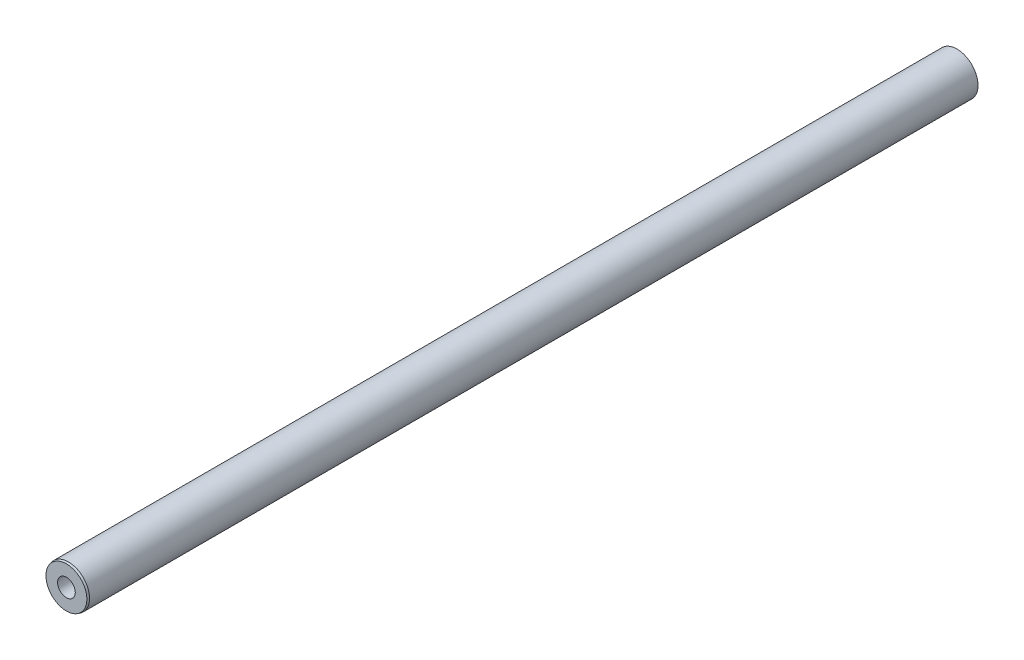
from build123d import *

# Parameters (mm, degrees)
SKETCH1_R          = 12.7
BASE_EXTRUDE_DEPTH = 538.2768
CHAMFER1_SIZE      = 1.27
CHAMFER1_SIZE2     = 0.340295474


with BuildPart() as part:
    # Sketch1 → Base-Extrude (new body)
    with BuildSketch(Plane.XY):
        Circle(SKETCH1_R)
    extrude(amount=BASE_EXTRUDE_DEPTH)

    # Chamfer1
    chamfer1_edges = [part.edges().sort_by_distance(p)[0] for p in [
        (-12.7, 0, 538.2768),
    ]]
    chamfer1_side = [part.faces().sort_by_distance(p)[0] for p in [
        (-12.7, 0, 269.1384),
    ]]
    chamfer(chamfer1_edges, length=CHAMFER1_SIZE, length2=CHAMFER1_SIZE2, reference=chamfer1_side[0])

    # Sketch2 → 1_2-13 Tapped Hole1 (revolve, cut)
    with BuildSketch(Plane(origin=(0, 0, 538.2768), x_dir=(0, -1, 0), z_dir=(1, 0, 0))):
        Polygon((0, 0), (0, 28.61946452), (5.358125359, 25.399978), (5.358125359, 0.002539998), (5.358125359, 0), align=None)
    revolve(axis=Axis((0, 0, 544.6268), (0, 0, -1)), mode=Mode.SUBTRACT)


solid = part.part
